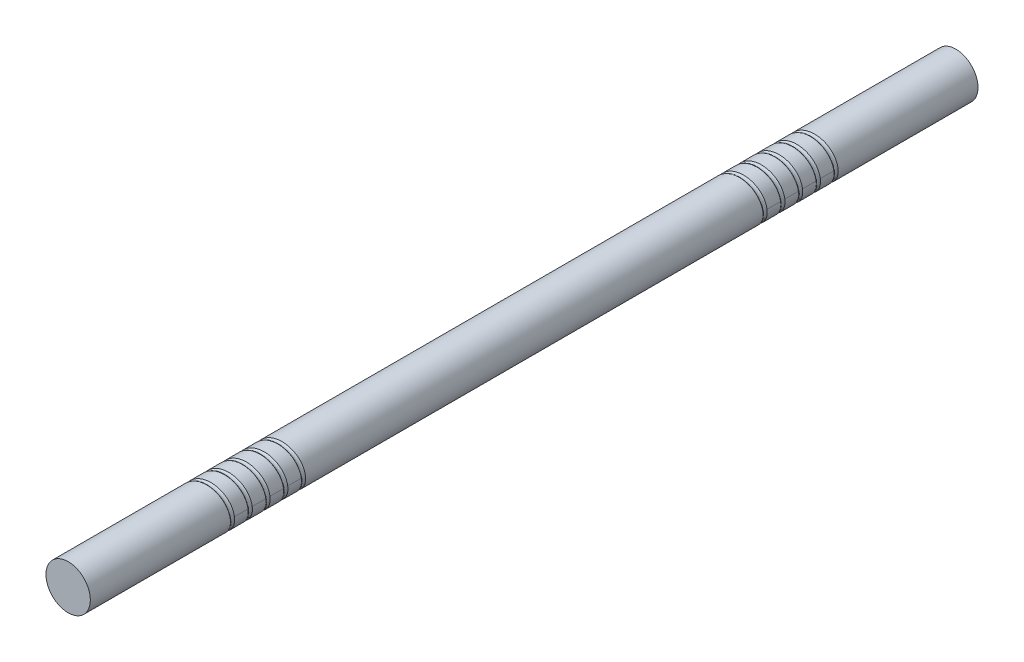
from build123d import *

# Parameters (mm, degrees)
SKETCH1_R              = 25
BOSS_EXTRUDE1_DEPTH    = 1000
CUT_SWEEP1_PITCH       = 20
CUT_SWEEP1_HEIGHT      = 100
CUT_SWEEP1_RADIUS      = 27.116666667
CUT_SWEEP1_START_ANGLE = -180
SKETCH3_R              = 3.175
LPATTERN1_COUNT        = 2
LPATTERN1_PITCH        = 600


with BuildPart() as part:
    # Sketch1 → Boss-Extrude1 (new body)
    with BuildSketch(Plane.XY):
        Circle(SKETCH1_R)
    extrude(amount=BOSS_EXTRUDE1_DEPTH)

    # Cut-Sweep1: sweep along a helix
    with BuildLine() as cut_sweep1_path:
        add(Helix(CUT_SWEEP1_PITCH, CUT_SWEEP1_HEIGHT, CUT_SWEEP1_RADIUS, center=(0, 0, 150), direction=(0, 0, 1), mode=Mode.PRIVATE).rotate(Axis((0, 0, 150), (0, 0, 1)), CUT_SWEEP1_START_ANGLE))
    # Sketch3 → Cut-Sweep1 (sweep, cut)
    with BuildSketch(Plane(origin=(0, 0, 0), x_dir=(1, 0, 0), z_dir=(0, 1, 0))):
        with Locations((-27.116666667, -150)):
            Circle(SKETCH3_R)
    cut_sweep1 = sweep(path=cut_sweep1_path.line, is_frenet=True, mode=Mode.SUBTRACT)

    # LPattern1: Cut-Sweep1 ×2
    with Locations(*[(0, 0, i * LPATTERN1_PITCH) for i in range(1, LPATTERN1_COUNT)]):
        add(cut_sweep1, mode=Mode.SUBTRACT)


solid = part.part
